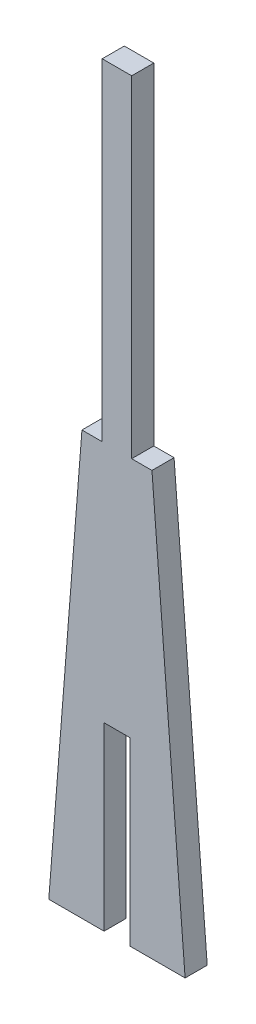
from build123d import *

# Parameters (mm, degrees)
SKETCH1_W           = 4
SKETCH1_H           = 45
BOSS_EXTRUDE1_DEPTH = 3


with BuildPart() as part:
    # Sketch1 → Boss-Extrude1 (new body)
    with BuildSketch(Plane.XY):
        Polygon((-4.75, 57.4), (-9.25, 0), (-1.75, 0), (-1.75, 24.5), (1.75, 24.5), (1.75, 0), (9.25, 0), (4.75, 57.4), (2, 57.4), (-2, 57.4), align=None)
        with Locations((0, 79.9)):
            Rectangle(SKETCH1_W, SKETCH1_H)
    extrude(amount=BOSS_EXTRUDE1_DEPTH)


solid = part.part
